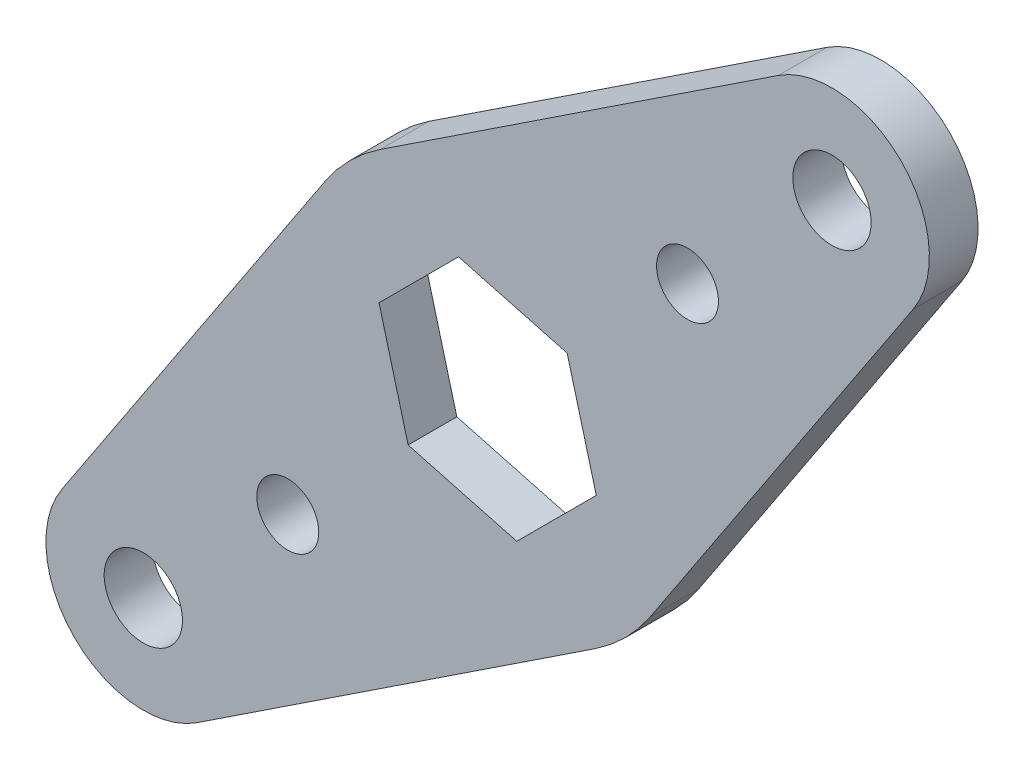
from build123d import *

# Parameters (mm, degrees)
SKETCH1_R           = 2.5527
SKETCH1_R_2         = 2.0193
BOSS_EXTRUDE1_DEPTH = 3.175


with BuildPart() as part:
    # Sketch1 → Boss-Extrude1 (new body)
    with BuildSketch(Plane.XY):
        with BuildLine():
            Line((-7.002766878, 10.594869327), (18.949256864, 27.748074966))
            ThreePointArc((18.949256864, 27.748074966), (26.940768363, 26.940768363), (27.748074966, 18.949256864))
            Line((27.748074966, 18.949256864), (10.594869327, -7.002766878))
            ThreePointArc((10.594869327, -7.002766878), (8.980256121, -8.980256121), (7.002766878, -10.594869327))
            Line((7.002766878, -10.594869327), (-18.949256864, -27.748074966))
            ThreePointArc((-18.949256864, -27.748074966), (-26.940768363, -26.940768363), (-27.748074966, -18.949256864))
            Line((-27.748074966, -18.949256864), (-10.594869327, 7.002766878))
            ThreePointArc((-10.594869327, 7.002766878), (-8.980256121, 8.980256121), (-7.002766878, 10.594869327))
        make_face()
        with Locations((22.450640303, 22.450640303)):
            Circle(SKETCH1_R, mode=Mode.SUBTRACT)
        with Locations((-22.450640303, -22.450640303)):
            Circle(SKETCH1_R, mode=Mode.SUBTRACT)
        with Locations((-13.030351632, -13.030351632)):
            Circle(SKETCH1_R_2, mode=Mode.SUBTRACT)
        with Locations((13.030351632, 13.030351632)):
            Circle(SKETCH1_R_2, mode=Mode.SUBTRACT)
        Polygon((-5.184753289, -5.184753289), (1.897751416, -7.082504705), (7.082504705, -1.897751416), (5.184753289, 5.184753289), (-1.897751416, 7.082504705), (-7.082504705, 1.897751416), align=None, mode=Mode.SUBTRACT)
    extrude(amount=BOSS_EXTRUDE1_DEPTH)


solid = part.part
